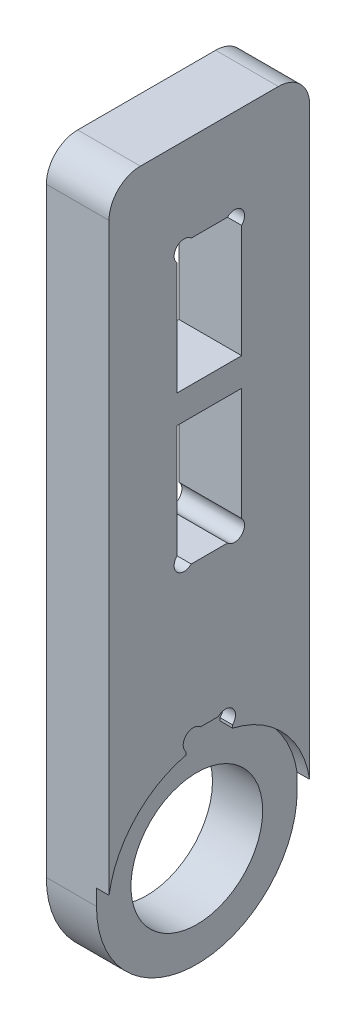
from build123d import *

# Parameters (mm, degrees)
ESQUISSE1_R             = 10.5
BOSS_EXTRU_1_DEPTH      = 10
ENL_V_MAT_EXTRU_1_DEPTH = 2
CONG_1_R                = 5


with BuildPart() as part:
    # Esquisse1 → Boss.-Extru.1 (new body)
    with BuildSketch(Plane(origin=(0, 0, 0), x_dir=(0, 0, -1), z_dir=(1, 0, 0))):
        with BuildLine():
            Line((16, 0), (16, 100.735))
            Line((16, 100.735), (-16, 100.735))
            Line((-16, 100.735), (-16, 0))
            ThreePointArc((-16, 0), (0, -16), (16, 0))
        make_face()
        Circle(ESQUISSE1_R, mode=Mode.SUBTRACT)
        with BuildLine():
            Line((5.15, 43.9977417), (5.15, 61.985))
            Line((5.15, 61.985), (-5.15, 61.985))
            Line((-5.15, 61.985), (-5.15, 43.9977417))
            ThreePointArc((-5.15, 43.9977417), (-5.15, 41.735), (-2.8872583, 41.735))
            Line((-2.8872583, 41.735), (2.8872583, 41.735))
            ThreePointArc((2.8872583, 41.735), (5.15, 41.735), (5.15, 43.9977417))
        make_face(mode=Mode.SUBTRACT)
        with BuildLine():
            Line((-2.8872583, 86.735), (2.8872583, 86.735))
            ThreePointArc((2.8872583, 86.735), (5.15, 86.735), (5.15, 84.4722583))
            Line((5.15, 84.4722583), (5.15, 66.485))
            Line((5.15, 66.485), (-5.15, 66.485))
            Line((-5.15, 66.485), (-5.15, 84.4722583))
            ThreePointArc((-5.15, 84.4722583), (-5.15, 86.735), (-2.8872583, 86.735))
        make_face(mode=Mode.SUBTRACT)
    extrude(amount=BOSS_EXTRU_1_DEPTH)

    # Esquisse2 → Enl_v. mat.-Extru.1 (cut)
    with BuildSketch(Plane(origin=(10, 0, 0), x_dir=(0, 0, -1), z_dir=(1, 0, 0))):
        with BuildLine():
            Line((3.7, 16.2372583), (3.7, 15.771810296))
            ThreePointArc((3.7, 15.771810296), (0, -16.2), (-3.7, 15.771810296))
            Line((-3.7, 15.771810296), (-3.7, 16.2372583))
            ThreePointArc((-3.7, 16.2372583), (-3.7, 18.5), (-1.4372583, 18.5))
            Line((-1.4372583, 18.5), (1.4372583, 18.5))
            ThreePointArc((1.4372583, 18.5), (3.7, 18.5), (3.7, 16.2372583))
        make_face()
    extrude(amount=-ENL_V_MAT_EXTRU_1_DEPTH, mode=Mode.SUBTRACT)

    # Cong_1
    cong_1_edges = [part.edges().sort_by_distance(p)[0] for p in [
        (5, 100.735, 16),
        (5, 100.735, -16),
    ]]
    fillet(cong_1_edges, radius=CONG_1_R)


solid = part.part
